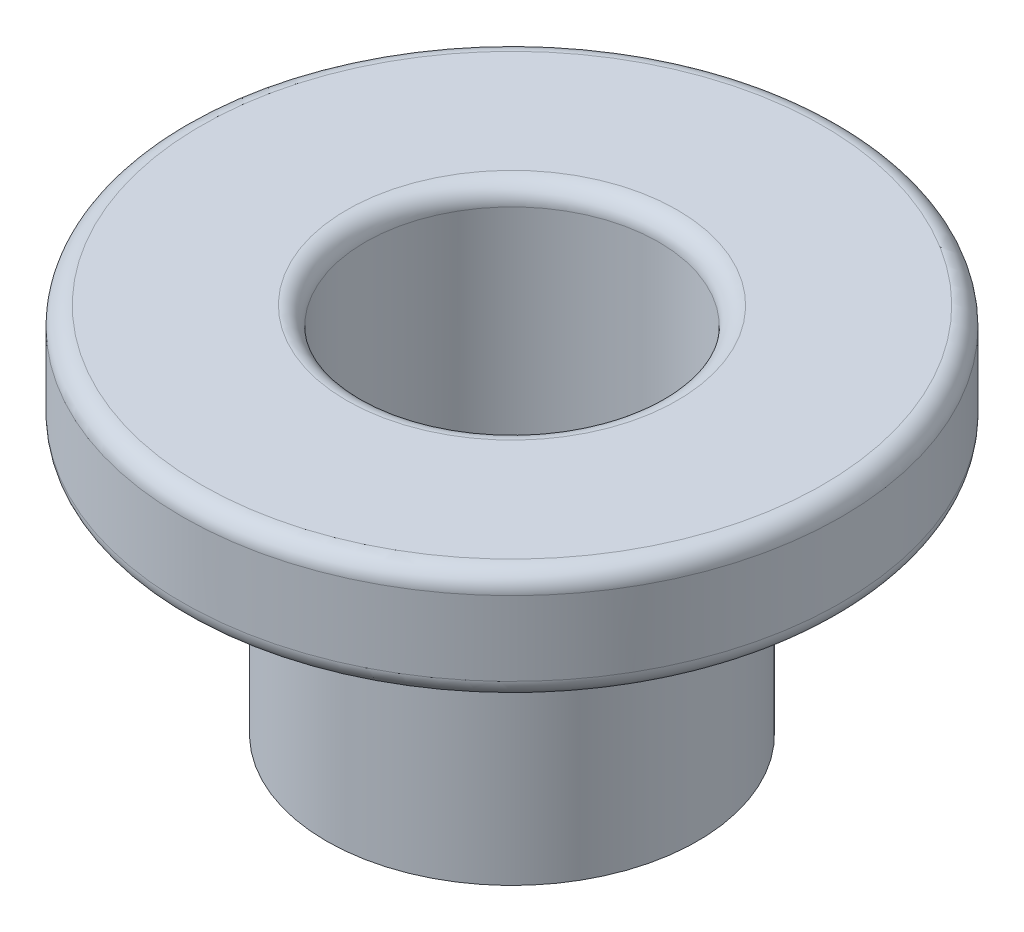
from build123d import *

# Parameters (mm, degrees)
FILLET1_R = 0.254


with BuildPart() as part:
    # Sketch1 → Revolve1 (revolve)
    with BuildSketch(Plane.XY, mode=Mode.PRIVATE) as revolve1_sk:
        Polygon((2.0066, 0), (2.0066, 5.08), (4.5085, 5.08), (4.5085, 3.556), (2.54, 3.556), (2.54, 0), align=None)
    revolve(revolve1_sk.sketch.rotate(Axis((0, 0, 0), (0, 1, 0)), 90), axis=Axis((0, 0, 0), (0, 1, 0)))

    # Fillet1
    fillet1_edges = [part.edges().sort_by_distance(p)[0] for p in [
        (0, 3.556, 4.5085),
        (0, 5.08, 4.5085),
        (0, 5.08, 2.0066),
    ]]
    fillet(fillet1_edges, radius=FILLET1_R)


solid = part.part
